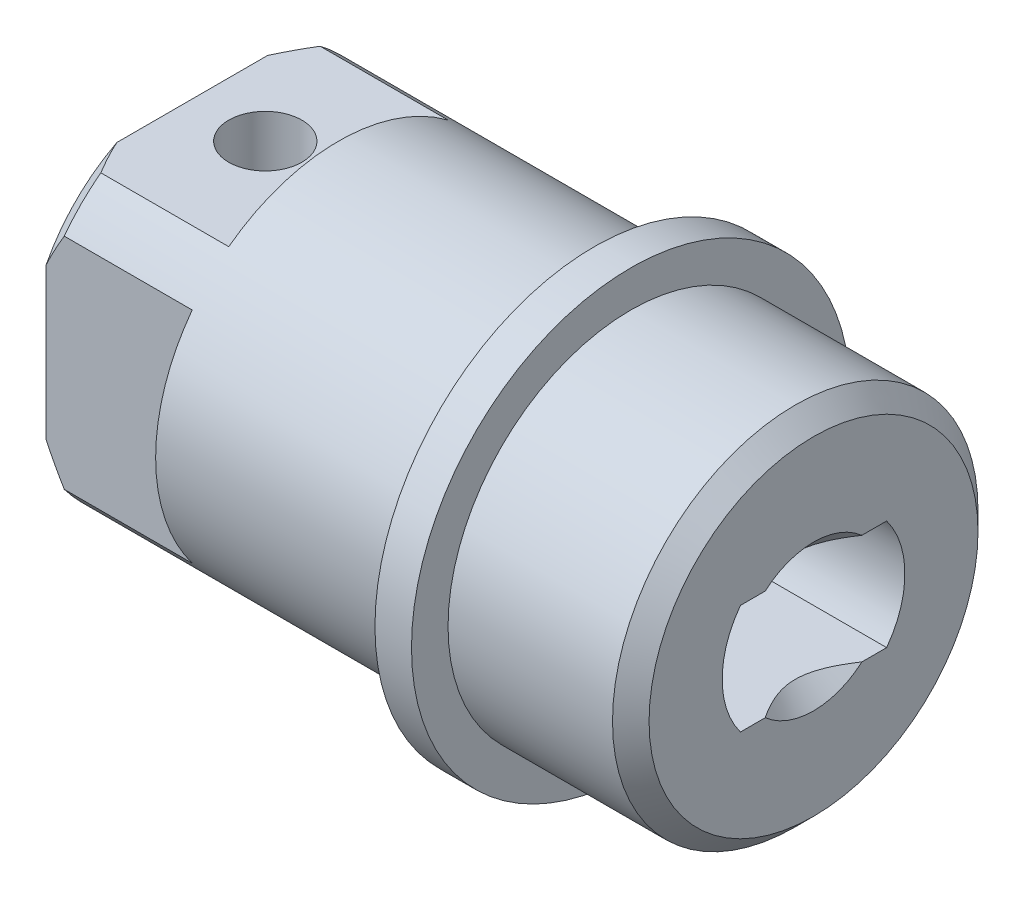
from build123d import *

# Parameters (mm, degrees)
CHAMFER_1_SIZE       = 0.5
SKETCH_2_OUTSIDE_W   = 18.804
SKETCH_2_OUTSIDE_H   = 18.804
SKETCH_2_OUTSIDE_W_2 = 8
SKETCH_2_OUTSIDE_H_2 = 8
CUT_EXTRUDE_1_DEPTH  = 4
SKETCH_3_R           = 1
CUT_EXTRUDE_2_DEPTH  = 12
CUT_EXTRUDE_3_DEPTH  = 10


with BuildPart() as part:
    # Sketch 1 → Revolve 1 (revolve)
    with BuildSketch(Plane.XY, mode=Mode.PRIVATE) as revolve_1_sk:
        Polygon((0, 0), (0, 5), (11, 5), (11, 6), (12, 6), (12, 5), (17, 5), (17, 1.5), (7, 1.5), (6.133974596, 0), align=None)
    revolve(revolve_1_sk.sketch.rotate(Axis((0, 0, 0), (1, 0, 0)), 90), axis=Axis((0, 0, 0), (1, 0, 0)))

    # Chamfer 1
    chamfer_1_edges = [part.edges().sort_by_distance(p)[0] for p in [
        (0, 0, -5),
        (17, 0, -1.5),
        (17, 0, -5),
    ]]
    chamfer(chamfer_1_edges, length=CHAMFER_1_SIZE)

    # Sketch 2 outside → Cut-Extrude 1 (cut)
    with BuildSketch(Plane.ZY):
        Rectangle(SKETCH_2_OUTSIDE_W, SKETCH_2_OUTSIDE_H)
        Rectangle(SKETCH_2_OUTSIDE_W_2, SKETCH_2_OUTSIDE_H_2, mode=Mode.SUBTRACT)
    extrude(amount=-CUT_EXTRUDE_1_DEPTH, mode=Mode.SUBTRACT)

    # Sketch 3 → Cut-Extrude 2 (cut, symmetric)
    with BuildSketch(Plane(origin=(0, 0, 0), x_dir=(1, 0, 0), z_dir=(0, 1, 0))):
        with Locations(Location((2, 0, 0), (0, 0, 270))):
            Circle(SKETCH_3_R)
    extrude(amount=CUT_EXTRUDE_2_DEPTH, both=True, mode=Mode.SUBTRACT)

    # Sketch 4 → Cut-Extrude 3 (cut)
    with BuildSketch(Plane(origin=(17, 0, 0), x_dir=(0, 0, -1), z_dir=(1, 0, 0))):
        with BuildLine():
            Line((-2, 1.5), (2, 1.5))
            ThreePointArc((2, 1.5), (2.5, 0), (2, -1.5))
            Line((2, -1.5), (-2, -1.5))
            ThreePointArc((-2, -1.5), (-2.5, 0), (-2, 1.5))
        make_face()
    extrude(amount=-CUT_EXTRUDE_3_DEPTH, mode=Mode.SUBTRACT)


solid = part.part
